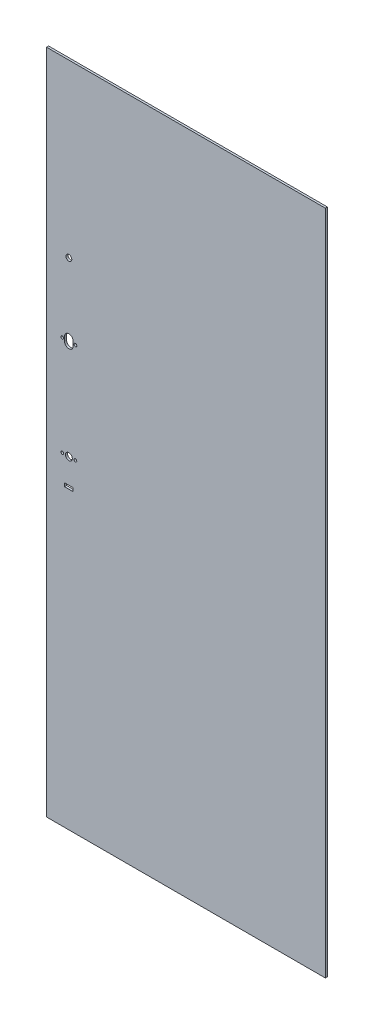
ISO-10303-21;
HEADER;
FILE_DESCRIPTION(('STEP AP214'),'2;1');
FILE_NAME('part.step','',(''),(''),'','','');
FILE_SCHEMA(('AUTOMOTIVE_DESIGN { 1 0 10303 214 1 1 1 1 }'));
ENDSEC;
DATA;
#1=APPLICATION_CONTEXT('core data for automotive mechanical design processes');
#2=APPLICATION_PROTOCOL_DEFINITION('international standard','automotive_design',2000,#1);
#3=PRODUCT_CONTEXT('',#1,'mechanical');
#4=PRODUCT('Part','Part','',(#3));
#5=PRODUCT_RELATED_PRODUCT_CATEGORY('part','',(#4));
#6=PRODUCT_DEFINITION_FORMATION('','',#4);
#7=PRODUCT_DEFINITION_CONTEXT('part definition',#1,'design');
#8=PRODUCT_DEFINITION('design','',#6,#7);
#9=PRODUCT_DEFINITION_SHAPE('','',#8);
#10=(LENGTH_UNIT() NAMED_UNIT(*) SI_UNIT(.MILLI.,.METRE.));
#11=(NAMED_UNIT(*) PLANE_ANGLE_UNIT() SI_UNIT($,.RADIAN.));
#12=(NAMED_UNIT(*) SI_UNIT($,.STERADIAN.) SOLID_ANGLE_UNIT());
#13=UNCERTAINTY_MEASURE_WITH_UNIT(LENGTH_MEASURE(1.E-05),#10,'distance_accuracy_value','');
#14=(GEOMETRIC_REPRESENTATION_CONTEXT(3) GLOBAL_UNCERTAINTY_ASSIGNED_CONTEXT((#13)) GLOBAL_UNIT_ASSIGNED_CONTEXT((#10,
#11,#12)) REPRESENTATION_CONTEXT('',''));
#15=CARTESIAN_POINT('',(0.,0.,0.));
#16=DIRECTION('',(0.,0.,1.));
#17=DIRECTION('',(1.,0.,0.));
#18=AXIS2_PLACEMENT_3D('',#15,#16,#17);
#19=CARTESIAN_POINT('',(-404.5,-969.099999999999,6.));
#20=DIRECTION('',(1.,0.,0.));
#21=DIRECTION('',(0.,0.,-1.));
#22=AXIS2_PLACEMENT_3D('',#19,#20,#21);
#23=PLANE('',#22);
#24=DIRECTION('',(0.,-1.,0.));
#25=VECTOR('',#24,1.);
#26=CARTESIAN_POINT('',(-404.5,-969.099999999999,0.));
#27=LINE('',#26,#25);
#28=CARTESIAN_POINT('',(-404.5,967.9,0.));
#29=VERTEX_POINT('',#28);
#30=CARTESIAN_POINT('',(-404.5,-969.099999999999,0.));
#31=VERTEX_POINT('',#30);
#32=EDGE_CURVE('E208',#29,#31,#27,.T.);
#33=ORIENTED_EDGE('',*,*,#32,.T.);
#34=DIRECTION('',(0.,0.,-1.));
#35=VECTOR('',#34,1.);
#36=CARTESIAN_POINT('',(-404.5,-969.099999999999,6.));
#37=LINE('',#36,#35);
#38=CARTESIAN_POINT('',(-404.5,-969.099999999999,6.));
#39=VERTEX_POINT('',#38);
#40=EDGE_CURVE('E225',#39,#31,#37,.T.);
#41=ORIENTED_EDGE('',*,*,#40,.F.);
#42=DIRECTION('',(0.,-1.,0.));
#43=VECTOR('',#42,1.);
#44=CARTESIAN_POINT('',(-404.5,-969.099999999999,6.));
#45=LINE('',#44,#43);
#46=CARTESIAN_POINT('',(-404.5,967.9,6.));
#47=VERTEX_POINT('',#46);
#48=EDGE_CURVE('E197',#47,#39,#45,.T.);
#49=ORIENTED_EDGE('',*,*,#48,.F.);
#50=DIRECTION('',(0.,0.,-1.));
#51=VECTOR('',#50,1.);
#52=CARTESIAN_POINT('',(-404.5,967.9,6.));
#53=LINE('',#52,#51);
#54=EDGE_CURVE('E207',#47,#29,#53,.T.);
#55=ORIENTED_EDGE('',*,*,#54,.T.);
#56=EDGE_LOOP('',(#33,#41,#49,#55));
#57=FACE_BOUND('',#56,.T.);
#58=ADVANCED_FACE('F38',(#57),#23,.F.);
#59=CARTESIAN_POINT('',(-404.5,-969.099999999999,6.));
#60=DIRECTION('',(0.,1.,0.));
#61=DIRECTION('',(0.,0.,1.));
#62=AXIS2_PLACEMENT_3D('',#59,#60,#61);
#63=PLANE('',#62);
#64=DIRECTION('',(1.,0.,0.));
#65=VECTOR('',#64,1.);
#66=CARTESIAN_POINT('',(-404.5,-969.099999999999,0.));
#67=LINE('',#66,#65);
#68=CARTESIAN_POINT('',(405.5,-969.099999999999,0.));
#69=VERTEX_POINT('',#68);
#70=EDGE_CURVE('E211',#31,#69,#67,.T.);
#71=ORIENTED_EDGE('',*,*,#70,.T.);
#72=DIRECTION('',(0.,0.,-1.));
#73=VECTOR('',#72,1.);
#74=CARTESIAN_POINT('',(405.5,-969.099999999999,6.));
#75=LINE('',#74,#73);
#76=CARTESIAN_POINT('',(405.5,-969.099999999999,6.));
#77=VERTEX_POINT('',#76);
#78=EDGE_CURVE('E222',#77,#69,#75,.T.);
#79=ORIENTED_EDGE('',*,*,#78,.F.);
#80=DIRECTION('',(1.,0.,0.));
#81=VECTOR('',#80,1.);
#82=CARTESIAN_POINT('',(-404.5,-969.099999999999,6.));
#83=LINE('',#82,#81);
#84=EDGE_CURVE('E200',#39,#77,#83,.T.);
#85=ORIENTED_EDGE('',*,*,#84,.F.);
#86=ORIENTED_EDGE('',*,*,#40,.T.);
#87=EDGE_LOOP('',(#71,#79,#85,#86));
#88=FACE_BOUND('',#87,.T.);
#89=ADVANCED_FACE('F273',(#88),#63,.F.);
#90=CARTESIAN_POINT('',(405.5,-969.099999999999,6.));
#91=DIRECTION('',(-1.,0.,0.));
#92=DIRECTION('',(0.,0.,1.));
#93=AXIS2_PLACEMENT_3D('',#90,#91,#92);
#94=PLANE('',#93);
#95=DIRECTION('',(0.,1.,0.));
#96=VECTOR('',#95,1.);
#97=CARTESIAN_POINT('',(405.5,-969.099999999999,0.));
#98=LINE('',#97,#96);
#99=CARTESIAN_POINT('',(405.5,967.9,0.));
#100=VERTEX_POINT('',#99);
#101=EDGE_CURVE('E214',#69,#100,#98,.T.);
#102=ORIENTED_EDGE('',*,*,#101,.T.);
#103=DIRECTION('',(0.,0.,-1.));
#104=VECTOR('',#103,1.);
#105=CARTESIAN_POINT('',(405.5,967.9,6.));
#106=LINE('',#105,#104);
#107=CARTESIAN_POINT('',(405.5,967.9,6.));
#108=VERTEX_POINT('',#107);
#109=EDGE_CURVE('E219',#108,#100,#106,.T.);
#110=ORIENTED_EDGE('',*,*,#109,.F.);
#111=DIRECTION('',(0.,1.,0.));
#112=VECTOR('',#111,1.);
#113=CARTESIAN_POINT('',(405.5,-969.099999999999,6.));
#114=LINE('',#113,#112);
#115=EDGE_CURVE('E203',#77,#108,#114,.T.);
#116=ORIENTED_EDGE('',*,*,#115,.F.);
#117=ORIENTED_EDGE('',*,*,#78,.T.);
#118=EDGE_LOOP('',(#102,#110,#116,#117));
#119=FACE_BOUND('',#118,.T.);
#120=ADVANCED_FACE('F278',(#119),#94,.F.);
#121=CARTESIAN_POINT('',(-404.5,967.9,6.));
#122=DIRECTION('',(0.,-1.,0.));
#123=DIRECTION('',(0.,0.,-1.));
#124=AXIS2_PLACEMENT_3D('',#121,#122,#123);
#125=PLANE('',#124);
#126=DIRECTION('',(-1.,0.,0.));
#127=VECTOR('',#126,1.);
#128=CARTESIAN_POINT('',(-404.5,967.9,0.));
#129=LINE('',#128,#127);
#130=EDGE_CURVE('E201',#100,#29,#129,.T.);
#131=ORIENTED_EDGE('',*,*,#130,.T.);
#132=ORIENTED_EDGE('',*,*,#54,.F.);
#133=DIRECTION('',(-1.,0.,0.));
#134=VECTOR('',#133,1.);
#135=CARTESIAN_POINT('',(-404.5,967.9,6.));
#136=LINE('',#135,#134);
#137=EDGE_CURVE('E205',#108,#47,#136,.T.);
#138=ORIENTED_EDGE('',*,*,#137,.F.);
#139=ORIENTED_EDGE('',*,*,#109,.T.);
#140=EDGE_LOOP('',(#131,#132,#138,#139));
#141=FACE_BOUND('',#140,.T.);
#142=ADVANCED_FACE('F293',(#141),#125,.F.);
#143=CARTESIAN_POINT('',(0.,0.,6.));
#144=DIRECTION('',(0.,0.,-1.));
#145=DIRECTION('',(-1.,0.,0.));
#146=AXIS2_PLACEMENT_3D('',#143,#144,#145);
#147=PLANE('',#146);
#148=DIRECTION('',(1.,0.,0.));
#149=VECTOR('',#148,1.);
#150=CARTESIAN_POINT('',(-352.199999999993,-101.800000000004,6.00000000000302));
#151=LINE('',#150,#149);
#152=CARTESIAN_POINT('',(-352.199999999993,-101.800000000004,6.00000000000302));
#153=VERTEX_POINT('',#152);
#154=CARTESIAN_POINT('',(-327.199999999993,-101.800000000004,6.00000000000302));
#155=VERTEX_POINT('',#154);
#156=EDGE_CURVE('E138',#153,#155,#151,.T.);
#157=ORIENTED_EDGE('',*,*,#156,.T.);
#158=DIRECTION('',(0.,-1.,0.));
#159=VECTOR('',#158,1.);
#160=CARTESIAN_POINT('',(-327.199999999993,-101.800000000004,6.00000000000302));
#161=LINE('',#160,#159);
#162=CARTESIAN_POINT('',(-327.199999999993,-111.800000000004,6.00000000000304));
#163=VERTEX_POINT('',#162);
#164=EDGE_CURVE('E132',#155,#163,#161,.T.);
#165=ORIENTED_EDGE('',*,*,#164,.T.);
#166=DIRECTION('',(-1.,0.,0.));
#167=VECTOR('',#166,1.);
#168=CARTESIAN_POINT('',(-327.199999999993,-111.800000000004,6.00000000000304));
#169=LINE('',#168,#167);
#170=CARTESIAN_POINT('',(-352.199999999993,-111.800000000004,6.));
#171=VERTEX_POINT('',#170);
#172=EDGE_CURVE('E141',#163,#171,#169,.T.);
#173=ORIENTED_EDGE('',*,*,#172,.T.);
#174=DIRECTION('',(0.,1.,0.));
#175=VECTOR('',#174,1.);
#176=CARTESIAN_POINT('',(-352.199999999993,-111.800000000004,6.00000000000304));
#177=LINE('',#176,#175);
#178=EDGE_CURVE('E52',#171,#153,#177,.T.);
#179=ORIENTED_EDGE('',*,*,#178,.T.);
#180=EDGE_LOOP('',(#157,#165,#173,#179));
#181=FACE_BOUND('',#180,.T.);
#182=CARTESIAN_POINT('',(-320.699999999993,260.399999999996,6.000000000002));
#183=DIRECTION('',(0.,0.,-1.));
#184=DIRECTION('',(0.,1.,0.));
#185=AXIS2_PLACEMENT_3D('',#182,#183,#184);
#186=CIRCLE('',#185,4.09999999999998);
#187=CARTESIAN_POINT('',(-320.699999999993,264.499999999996,6.00000000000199));
#188=VERTEX_POINT('',#187);
#189=EDGE_CURVE('E170',#188,#188,#186,.T.);
#190=ORIENTED_EDGE('',*,*,#189,.T.);
#191=EDGE_LOOP('',(#190));
#192=FACE_BOUND('',#191,.T.);
#193=CARTESIAN_POINT('',(-358.699999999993,260.399999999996,6.000000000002));
#194=DIRECTION('',(0.,0.,-1.));
#195=DIRECTION('',(0.,1.,0.));
#196=AXIS2_PLACEMENT_3D('',#193,#194,#195);
#197=CIRCLE('',#196,4.09999999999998);
#198=CARTESIAN_POINT('',(-358.699999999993,264.499999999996,6.00000000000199));
#199=VERTEX_POINT('',#198);
#200=EDGE_CURVE('E167',#199,#199,#197,.T.);
#201=ORIENTED_EDGE('',*,*,#200,.T.);
#202=EDGE_LOOP('',(#201));
#203=FACE_BOUND('',#202,.T.);
#204=CARTESIAN_POINT('',(-339.699999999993,470.200000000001,6.00000000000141));
#205=DIRECTION('',(0.,0.,-1.));
#206=DIRECTION('',(0.,1.,0.));
#207=AXIS2_PLACEMENT_3D('',#204,#205,#206);
#208=CIRCLE('',#207,8.50000000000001);
#209=CARTESIAN_POINT('',(-339.699999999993,478.700000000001,6.00000000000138));
#210=VERTEX_POINT('',#209);
#211=EDGE_CURVE('E163',#210,#210,#208,.T.);
#212=ORIENTED_EDGE('',*,*,#211,.T.);
#213=EDGE_LOOP('',(#212));
#214=FACE_BOUND('',#213,.T.);
#215=CARTESIAN_POINT('',(-339.699999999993,-29.8000000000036,6.00000000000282));
#216=DIRECTION('',(0.,0.,-1.));
#217=DIRECTION('',(0.,1.,0.));
#218=AXIS2_PLACEMENT_3D('',#215,#216,#217);
#219=CIRCLE('',#218,9.99999999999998);
#220=CARTESIAN_POINT('',(-339.699999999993,-19.8000000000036,6.0000000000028));
#221=VERTEX_POINT('',#220);
#222=EDGE_CURVE('E148',#221,#221,#219,.T.);
#223=ORIENTED_EDGE('',*,*,#222,.T.);
#224=EDGE_LOOP('',(#223));
#225=FACE_BOUND('',#224,.T.);
#226=DIRECTION('',(0.,1.,0.));
#227=VECTOR('',#226,1.);
#228=CARTESIAN_POINT('',(-352.199999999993,254.149999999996,6.00000000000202));
#229=LINE('',#228,#227);
#230=CARTESIAN_POINT('',(-352.199999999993,254.149999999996,6.00000000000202));
#231=VERTEX_POINT('',#230);
#232=CARTESIAN_POINT('',(-352.199999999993,266.649999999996,6.00000000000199));
#233=VERTEX_POINT('',#232);
#234=EDGE_CURVE('E185',#231,#233,#229,.T.);
#235=ORIENTED_EDGE('',*,*,#234,.T.);
#236=CARTESIAN_POINT('',(-339.699999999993,266.649999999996,6.00000000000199));
#237=DIRECTION('',(0.,0.,-1.));
#238=DIRECTION('',(0.,1.,0.));
#239=AXIS2_PLACEMENT_3D('',#236,#237,#238);
#240=CIRCLE('',#239,12.5);
#241=CARTESIAN_POINT('',(-327.199999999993,266.649999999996,6.00000000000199));
#242=VERTEX_POINT('',#241);
#243=EDGE_CURVE('E176',#233,#242,#240,.T.);
#244=ORIENTED_EDGE('',*,*,#243,.T.);
#245=DIRECTION('',(0.,-1.,0.));
#246=VECTOR('',#245,1.);
#247=CARTESIAN_POINT('',(-327.199999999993,266.649999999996,6.00000000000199));
#248=LINE('',#247,#246);
#249=CARTESIAN_POINT('',(-327.199999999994,254.149999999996,6.));
#250=VERTEX_POINT('',#249);
#251=EDGE_CURVE('E181',#242,#250,#248,.T.);
#252=ORIENTED_EDGE('',*,*,#251,.T.);
#253=CARTESIAN_POINT('',(-339.699999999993,254.149999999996,6.00000000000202));
#254=DIRECTION('',(0.,0.,-1.));
#255=DIRECTION('',(0.,1.,0.));
#256=AXIS2_PLACEMENT_3D('',#253,#254,#255);
#257=CIRCLE('',#256,12.5);
#258=EDGE_CURVE('E60',#250,#231,#257,.T.);
#259=ORIENTED_EDGE('',*,*,#258,.T.);
#260=EDGE_LOOP('',(#235,#244,#252,#259));
#261=FACE_BOUND('',#260,.T.);
#262=CARTESIAN_POINT('',(-358.699999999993,-29.8000000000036,6.00000000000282));
#263=DIRECTION('',(0.,0.,-1.));
#264=DIRECTION('',(0.,1.,0.));
#265=AXIS2_PLACEMENT_3D('',#262,#263,#264);
#266=CIRCLE('',#265,3.99999999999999);
#267=CARTESIAN_POINT('',(-358.699999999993,-25.8000000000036,6.00000000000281));
#268=VERTEX_POINT('',#267);
#269=EDGE_CURVE('E173',#268,#268,#266,.T.);
#270=ORIENTED_EDGE('',*,*,#269,.T.);
#271=EDGE_LOOP('',(#270));
#272=FACE_BOUND('',#271,.T.);
#273=CARTESIAN_POINT('',(-320.699999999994,-29.8000000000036,6.00000000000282));
#274=DIRECTION('',(0.,0.,-1.));
#275=DIRECTION('',(0.,1.,0.));
#276=AXIS2_PLACEMENT_3D('',#273,#274,#275);
#277=CIRCLE('',#276,3.99999999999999);
#278=CARTESIAN_POINT('',(-320.699999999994,-25.8000000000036,6.00000000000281));
#279=VERTEX_POINT('',#278);
#280=EDGE_CURVE('E166',#279,#279,#277,.T.);
#281=ORIENTED_EDGE('',*,*,#280,.T.);
#282=EDGE_LOOP('',(#281));
#283=FACE_BOUND('',#282,.T.);
#284=ORIENTED_EDGE('',*,*,#48,.T.);
#285=ORIENTED_EDGE('',*,*,#84,.T.);
#286=ORIENTED_EDGE('',*,*,#115,.T.);
#287=ORIENTED_EDGE('',*,*,#137,.T.);
#288=EDGE_LOOP('',(#284,#285,#286,#287));
#289=FACE_BOUND('',#288,.T.);
#290=ADVANCED_FACE('F145',(#181,#192,#203,#214,#225,#261,#272,#283,#289),#147,.F.);
#291=CARTESIAN_POINT('',(0.,0.,0.));
#292=DIRECTION('',(0.,0.,-1.));
#293=DIRECTION('',(-1.,0.,0.));
#294=AXIS2_PLACEMENT_3D('',#291,#292,#293);
#295=PLANE('',#294);
#296=DIRECTION('',(0.,-1.,0.));
#297=VECTOR('',#296,1.);
#298=CARTESIAN_POINT('',(-327.199999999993,0.,0.));
#299=LINE('',#298,#297);
#300=CARTESIAN_POINT('',(-327.199999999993,-101.800000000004,0.));
#301=VERTEX_POINT('',#300);
#302=CARTESIAN_POINT('',(-327.199999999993,-111.800000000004,0.));
#303=VERTEX_POINT('',#302);
#304=EDGE_CURVE('E11',#301,#303,#299,.T.);
#305=ORIENTED_EDGE('',*,*,#304,.F.);
#306=DIRECTION('',(1.,0.,0.));
#307=VECTOR('',#306,1.);
#308=CARTESIAN_POINT('',(0.,-101.800000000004,0.));
#309=LINE('',#308,#307);
#310=CARTESIAN_POINT('',(-352.199999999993,-101.800000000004,0.));
#311=VERTEX_POINT('',#310);
#312=EDGE_CURVE('E45',#311,#301,#309,.T.);
#313=ORIENTED_EDGE('',*,*,#312,.F.);
#314=DIRECTION('',(0.,1.,0.));
#315=VECTOR('',#314,1.);
#316=CARTESIAN_POINT('',(-352.199999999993,0.,0.));
#317=LINE('',#316,#315);
#318=CARTESIAN_POINT('',(-352.199999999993,-111.800000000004,0.));
#319=VERTEX_POINT('',#318);
#320=EDGE_CURVE('E255',#319,#311,#317,.T.);
#321=ORIENTED_EDGE('',*,*,#320,.F.);
#322=DIRECTION('',(-1.,0.,0.));
#323=VECTOR('',#322,1.);
#324=CARTESIAN_POINT('',(0.,-111.800000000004,0.));
#325=LINE('',#324,#323);
#326=EDGE_CURVE('E243',#303,#319,#325,.T.);
#327=ORIENTED_EDGE('',*,*,#326,.F.);
#328=EDGE_LOOP('',(#305,#313,#321,#327));
#329=FACE_BOUND('',#328,.T.);
#330=CARTESIAN_POINT('',(-320.699999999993,260.399999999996,0.));
#331=DIRECTION('',(0.,0.,-1.));
#332=DIRECTION('',(-1.,0.,0.));
#333=AXIS2_PLACEMENT_3D('',#330,#331,#332);
#334=CIRCLE('',#333,4.09999999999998);
#335=CARTESIAN_POINT('',(-324.799999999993,260.399999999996,0.));
#336=VERTEX_POINT('',#335);
#337=EDGE_CURVE('E212',#336,#336,#334,.T.);
#338=ORIENTED_EDGE('',*,*,#337,.F.);
#339=EDGE_LOOP('',(#338));
#340=FACE_BOUND('',#339,.T.);
#341=CARTESIAN_POINT('',(-358.699999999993,260.399999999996,0.));
#342=DIRECTION('',(0.,0.,-1.));
#343=DIRECTION('',(-1.,0.,0.));
#344=AXIS2_PLACEMENT_3D('',#341,#342,#343);
#345=CIRCLE('',#344,4.09999999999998);
#346=CARTESIAN_POINT('',(-362.799999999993,260.399999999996,0.));
#347=VERTEX_POINT('',#346);
#348=EDGE_CURVE('E249',#347,#347,#345,.T.);
#349=ORIENTED_EDGE('',*,*,#348,.F.);
#350=EDGE_LOOP('',(#349));
#351=FACE_BOUND('',#350,.T.);
#352=CARTESIAN_POINT('',(-339.699999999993,470.200000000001,0.));
#353=DIRECTION('',(0.,0.,-1.));
#354=DIRECTION('',(-1.,0.,0.));
#355=AXIS2_PLACEMENT_3D('',#352,#353,#354);
#356=CIRCLE('',#355,8.50000000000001);
#357=CARTESIAN_POINT('',(-348.199999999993,470.200000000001,0.));
#358=VERTEX_POINT('',#357);
#359=EDGE_CURVE('E246',#358,#358,#356,.T.);
#360=ORIENTED_EDGE('',*,*,#359,.F.);
#361=EDGE_LOOP('',(#360));
#362=FACE_BOUND('',#361,.T.);
#363=CARTESIAN_POINT('',(-339.699999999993,-29.8000000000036,0.));
#364=DIRECTION('',(0.,0.,-1.));
#365=DIRECTION('',(-1.,0.,0.));
#366=AXIS2_PLACEMENT_3D('',#363,#364,#365);
#367=CIRCLE('',#366,9.99999999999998);
#368=CARTESIAN_POINT('',(-349.699999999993,-29.8000000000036,0.));
#369=VERTEX_POINT('',#368);
#370=EDGE_CURVE('E234',#369,#369,#367,.T.);
#371=ORIENTED_EDGE('',*,*,#370,.F.);
#372=EDGE_LOOP('',(#371));
#373=FACE_BOUND('',#372,.T.);
#374=CARTESIAN_POINT('',(-339.699999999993,266.649999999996,0.));
#375=DIRECTION('',(0.,0.,-1.));
#376=DIRECTION('',(-1.,0.,0.));
#377=AXIS2_PLACEMENT_3D('',#374,#375,#376);
#378=CIRCLE('',#377,12.5);
#379=CARTESIAN_POINT('',(-352.199999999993,266.649999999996,0.));
#380=VERTEX_POINT('',#379);
#381=CARTESIAN_POINT('',(-327.199999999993,266.649999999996,0.));
#382=VERTEX_POINT('',#381);
#383=EDGE_CURVE('E240',#380,#382,#378,.T.);
#384=ORIENTED_EDGE('',*,*,#383,.F.);
#385=DIRECTION('',(0.,1.,0.));
#386=VECTOR('',#385,1.);
#387=CARTESIAN_POINT('',(-352.199999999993,0.,0.));
#388=LINE('',#387,#386);
#389=CARTESIAN_POINT('',(-352.199999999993,254.149999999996,0.));
#390=VERTEX_POINT('',#389);
#391=EDGE_CURVE('E238',#390,#380,#388,.T.);
#392=ORIENTED_EDGE('',*,*,#391,.F.);
#393=CARTESIAN_POINT('',(-339.699999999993,254.149999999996,0.));
#394=DIRECTION('',(0.,0.,-1.));
#395=DIRECTION('',(-1.,0.,0.));
#396=AXIS2_PLACEMENT_3D('',#393,#394,#395);
#397=CIRCLE('',#396,12.5);
#398=CARTESIAN_POINT('',(-327.199999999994,254.149999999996,0.));
#399=VERTEX_POINT('',#398);
#400=EDGE_CURVE('E236',#399,#390,#397,.T.);
#401=ORIENTED_EDGE('',*,*,#400,.F.);
#402=DIRECTION('',(0.,-1.,0.));
#403=VECTOR('',#402,1.);
#404=CARTESIAN_POINT('',(-327.199999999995,1.45305989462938E-12,0.));
#405=LINE('',#404,#403);
#406=EDGE_CURVE('E228',#382,#399,#405,.T.);
#407=ORIENTED_EDGE('',*,*,#406,.F.);
#408=EDGE_LOOP('',(#384,#392,#401,#407));
#409=FACE_BOUND('',#408,.T.);
#410=CARTESIAN_POINT('',(-358.699999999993,-29.8000000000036,0.));
#411=DIRECTION('',(0.,0.,-1.));
#412=DIRECTION('',(-1.,0.,0.));
#413=AXIS2_PLACEMENT_3D('',#410,#411,#412);
#414=CIRCLE('',#413,3.99999999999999);
#415=CARTESIAN_POINT('',(-362.699999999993,-29.8000000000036,0.));
#416=VERTEX_POINT('',#415);
#417=EDGE_CURVE('E231',#416,#416,#414,.T.);
#418=ORIENTED_EDGE('',*,*,#417,.F.);
#419=EDGE_LOOP('',(#418));
#420=FACE_BOUND('',#419,.T.);
#421=CARTESIAN_POINT('',(-320.699999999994,-29.8000000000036,0.));
#422=DIRECTION('',(0.,0.,-1.));
#423=DIRECTION('',(-1.,0.,0.));
#424=AXIS2_PLACEMENT_3D('',#421,#422,#423);
#425=CIRCLE('',#424,3.99999999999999);
#426=CARTESIAN_POINT('',(-324.699999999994,-29.8000000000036,0.));
#427=VERTEX_POINT('',#426);
#428=EDGE_CURVE('E158',#427,#427,#425,.T.);
#429=ORIENTED_EDGE('',*,*,#428,.F.);
#430=EDGE_LOOP('',(#429));
#431=FACE_BOUND('',#430,.T.);
#432=ORIENTED_EDGE('',*,*,#32,.F.);
#433=ORIENTED_EDGE('',*,*,#130,.F.);
#434=ORIENTED_EDGE('',*,*,#101,.F.);
#435=ORIENTED_EDGE('',*,*,#70,.F.);
#436=EDGE_LOOP('',(#432,#433,#434,#435));
#437=FACE_BOUND('',#436,.T.);
#438=ADVANCED_FACE('F261',(#329,#340,#351,#362,#373,#409,#420,#431,#437),#295,.T.);
#439=CARTESIAN_POINT('',(-320.699999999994,-29.8000000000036,6.00000000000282));
#440=DIRECTION('',(0.,0.,-1.));
#441=DIRECTION('',(0.,1.,0.));
#442=AXIS2_PLACEMENT_3D('',#439,#440,#441);
#443=CYLINDRICAL_SURFACE('',#442,3.99999999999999);
#444=ORIENTED_EDGE('',*,*,#428,.T.);
#445=EDGE_LOOP('',(#444));
#446=FACE_BOUND('',#445,.T.);
#447=ORIENTED_EDGE('',*,*,#280,.F.);
#448=EDGE_LOOP('',(#447));
#449=FACE_BOUND('',#448,.T.);
#450=ADVANCED_FACE('F304',(#446,#449),#443,.F.);
#451=CARTESIAN_POINT('',(-358.699999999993,-29.8000000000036,6.00000000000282));
#452=DIRECTION('',(0.,0.,-1.));
#453=DIRECTION('',(0.,1.,0.));
#454=AXIS2_PLACEMENT_3D('',#451,#452,#453);
#455=CYLINDRICAL_SURFACE('',#454,3.99999999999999);
#456=ORIENTED_EDGE('',*,*,#417,.T.);
#457=EDGE_LOOP('',(#456));
#458=FACE_BOUND('',#457,.T.);
#459=ORIENTED_EDGE('',*,*,#269,.F.);
#460=EDGE_LOOP('',(#459));
#461=FACE_BOUND('',#460,.T.);
#462=ADVANCED_FACE('F311',(#458,#461),#455,.F.);
#463=CARTESIAN_POINT('',(-339.699999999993,266.649999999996,6.00000000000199));
#464=DIRECTION('',(0.,0.,-1.));
#465=DIRECTION('',(0.,1.,0.));
#466=AXIS2_PLACEMENT_3D('',#463,#464,#465);
#467=CYLINDRICAL_SURFACE('',#466,12.5);
#468=ORIENTED_EDGE('',*,*,#383,.T.);
#469=DIRECTION('',(0.,0.,-1.));
#470=VECTOR('',#469,1.);
#471=CARTESIAN_POINT('',(-327.199999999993,266.649999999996,6.00000000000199));
#472=LINE('',#471,#470);
#473=EDGE_CURVE('E188',#242,#382,#472,.T.);
#474=ORIENTED_EDGE('',*,*,#473,.F.);
#475=ORIENTED_EDGE('',*,*,#243,.F.);
#476=DIRECTION('',(0.,0.,-1.));
#477=VECTOR('',#476,1.);
#478=CARTESIAN_POINT('',(-352.199999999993,266.649999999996,6.00000000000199));
#479=LINE('',#478,#477);
#480=EDGE_CURVE('E151',#233,#380,#479,.T.);
#481=ORIENTED_EDGE('',*,*,#480,.T.);
#482=EDGE_LOOP('',(#468,#474,#475,#481));
#483=FACE_BOUND('',#482,.T.);
#484=ADVANCED_FACE('F307',(#483),#467,.F.);
#485=CARTESIAN_POINT('',(-352.199999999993,254.149999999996,6.00000000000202));
#486=DIRECTION('',(-1.,0.,0.));
#487=DIRECTION('',(0.,0.,1.));
#488=AXIS2_PLACEMENT_3D('',#485,#486,#487);
#489=PLANE('',#488);
#490=ORIENTED_EDGE('',*,*,#391,.T.);
#491=ORIENTED_EDGE('',*,*,#480,.F.);
#492=ORIENTED_EDGE('',*,*,#234,.F.);
#493=DIRECTION('',(0.,0.,-1.));
#494=VECTOR('',#493,1.);
#495=CARTESIAN_POINT('',(-352.199999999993,254.149999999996,6.00000000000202));
#496=LINE('',#495,#494);
#497=EDGE_CURVE('E191',#231,#390,#496,.T.);
#498=ORIENTED_EDGE('',*,*,#497,.T.);
#499=EDGE_LOOP('',(#490,#491,#492,#498));
#500=FACE_BOUND('',#499,.T.);
#501=ADVANCED_FACE('F310',(#500),#489,.F.);
#502=CARTESIAN_POINT('',(-339.699999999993,254.149999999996,6.00000000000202));
#503=DIRECTION('',(0.,0.,-1.));
#504=DIRECTION('',(0.,1.,0.));
#505=AXIS2_PLACEMENT_3D('',#502,#503,#504);
#506=CYLINDRICAL_SURFACE('',#505,12.5);
#507=ORIENTED_EDGE('',*,*,#400,.T.);
#508=ORIENTED_EDGE('',*,*,#497,.F.);
#509=ORIENTED_EDGE('',*,*,#258,.F.);
#510=DIRECTION('',(0.,0.,-1.));
#511=VECTOR('',#510,1.);
#512=CARTESIAN_POINT('',(-327.199999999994,254.149999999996,6.00000000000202));
#513=LINE('',#512,#511);
#514=EDGE_CURVE('E194',#250,#399,#513,.T.);
#515=ORIENTED_EDGE('',*,*,#514,.T.);
#516=EDGE_LOOP('',(#507,#508,#509,#515));
#517=FACE_BOUND('',#516,.T.);
#518=ADVANCED_FACE('F317',(#517),#506,.F.);
#519=CARTESIAN_POINT('',(-327.199999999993,266.649999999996,6.00000000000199));
#520=DIRECTION('',(1.,0.,0.));
#521=DIRECTION('',(0.,1.,0.));
#522=AXIS2_PLACEMENT_3D('',#519,#520,#521);
#523=PLANE('',#522);
#524=ORIENTED_EDGE('',*,*,#406,.T.);
#525=ORIENTED_EDGE('',*,*,#514,.F.);
#526=ORIENTED_EDGE('',*,*,#251,.F.);
#527=ORIENTED_EDGE('',*,*,#473,.T.);
#528=EDGE_LOOP('',(#524,#525,#526,#527));
#529=FACE_BOUND('',#528,.T.);
#530=ADVANCED_FACE('F313',(#529),#523,.F.);
#531=CARTESIAN_POINT('',(-339.699999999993,-29.8000000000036,6.00000000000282));
#532=DIRECTION('',(0.,0.,-1.));
#533=DIRECTION('',(0.,1.,0.));
#534=AXIS2_PLACEMENT_3D('',#531,#532,#533);
#535=CYLINDRICAL_SURFACE('',#534,9.99999999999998);
#536=ORIENTED_EDGE('',*,*,#370,.T.);
#537=EDGE_LOOP('',(#536));
#538=FACE_BOUND('',#537,.T.);
#539=ORIENTED_EDGE('',*,*,#222,.F.);
#540=EDGE_LOOP('',(#539));
#541=FACE_BOUND('',#540,.T.);
#542=ADVANCED_FACE('F316',(#538,#541),#535,.F.);
#543=CARTESIAN_POINT('',(-339.699999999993,470.200000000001,6.00000000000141));
#544=DIRECTION('',(0.,0.,-1.));
#545=DIRECTION('',(0.,1.,0.));
#546=AXIS2_PLACEMENT_3D('',#543,#544,#545);
#547=CYLINDRICAL_SURFACE('',#546,8.50000000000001);
#548=ORIENTED_EDGE('',*,*,#359,.T.);
#549=EDGE_LOOP('',(#548));
#550=FACE_BOUND('',#549,.T.);
#551=ORIENTED_EDGE('',*,*,#211,.F.);
#552=EDGE_LOOP('',(#551));
#553=FACE_BOUND('',#552,.T.);
#554=ADVANCED_FACE('F326',(#550,#553),#547,.F.);
#555=CARTESIAN_POINT('',(-358.699999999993,260.399999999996,6.000000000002));
#556=DIRECTION('',(0.,0.,-1.));
#557=DIRECTION('',(0.,1.,0.));
#558=AXIS2_PLACEMENT_3D('',#555,#556,#557);
#559=CYLINDRICAL_SURFACE('',#558,4.09999999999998);
#560=ORIENTED_EDGE('',*,*,#348,.T.);
#561=EDGE_LOOP('',(#560));
#562=FACE_BOUND('',#561,.T.);
#563=ORIENTED_EDGE('',*,*,#200,.F.);
#564=EDGE_LOOP('',(#563));
#565=FACE_BOUND('',#564,.T.);
#566=ADVANCED_FACE('F337',(#562,#565),#559,.F.);
#567=CARTESIAN_POINT('',(-320.699999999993,260.399999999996,6.000000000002));
#568=DIRECTION('',(0.,0.,-1.));
#569=DIRECTION('',(0.,1.,0.));
#570=AXIS2_PLACEMENT_3D('',#567,#568,#569);
#571=CYLINDRICAL_SURFACE('',#570,4.09999999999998);
#572=ORIENTED_EDGE('',*,*,#337,.T.);
#573=EDGE_LOOP('',(#572));
#574=FACE_BOUND('',#573,.T.);
#575=ORIENTED_EDGE('',*,*,#189,.F.);
#576=EDGE_LOOP('',(#575));
#577=FACE_BOUND('',#576,.T.);
#578=ADVANCED_FACE('F334',(#574,#577),#571,.F.);
#579=CARTESIAN_POINT('',(-327.199999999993,-101.800000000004,6.00000000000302));
#580=DIRECTION('',(1.,0.,0.));
#581=DIRECTION('',(0.,0.,-1.));
#582=AXIS2_PLACEMENT_3D('',#579,#580,#581);
#583=PLANE('',#582);
#584=ORIENTED_EDGE('',*,*,#304,.T.);
#585=DIRECTION('',(0.,0.,-1.));
#586=VECTOR('',#585,1.);
#587=CARTESIAN_POINT('',(-327.199999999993,-111.800000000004,6.00000000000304));
#588=LINE('',#587,#586);
#589=EDGE_CURVE('E127',#163,#303,#588,.T.);
#590=ORIENTED_EDGE('',*,*,#589,.F.);
#591=ORIENTED_EDGE('',*,*,#164,.F.);
#592=DIRECTION('',(0.,0.,-1.));
#593=VECTOR('',#592,1.);
#594=CARTESIAN_POINT('',(-327.199999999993,-101.800000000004,6.00000000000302));
#595=LINE('',#594,#593);
#596=EDGE_CURVE('E156',#155,#301,#595,.T.);
#597=ORIENTED_EDGE('',*,*,#596,.T.);
#598=EDGE_LOOP('',(#584,#590,#591,#597));
#599=FACE_BOUND('',#598,.T.);
#600=ADVANCED_FACE('F129',(#599),#583,.F.);
#601=CARTESIAN_POINT('',(-352.199999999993,-101.800000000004,6.00000000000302));
#602=DIRECTION('',(0.,1.,0.));
#603=DIRECTION('',(0.,0.,1.));
#604=AXIS2_PLACEMENT_3D('',#601,#602,#603);
#605=PLANE('',#604);
#606=ORIENTED_EDGE('',*,*,#312,.T.);
#607=ORIENTED_EDGE('',*,*,#596,.F.);
#608=ORIENTED_EDGE('',*,*,#156,.F.);
#609=DIRECTION('',(0.,0.,-1.));
#610=VECTOR('',#609,1.);
#611=CARTESIAN_POINT('',(-352.199999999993,-101.800000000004,6.00000000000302));
#612=LINE('',#611,#610);
#613=EDGE_CURVE('E159',#153,#311,#612,.T.);
#614=ORIENTED_EDGE('',*,*,#613,.T.);
#615=EDGE_LOOP('',(#606,#607,#608,#614));
#616=FACE_BOUND('',#615,.T.);
#617=ADVANCED_FACE('F258',(#616),#605,.F.);
#618=CARTESIAN_POINT('',(-352.199999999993,-111.800000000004,6.00000000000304));
#619=DIRECTION('',(-1.,0.,0.));
#620=DIRECTION('',(0.,0.,1.));
#621=AXIS2_PLACEMENT_3D('',#618,#619,#620);
#622=PLANE('',#621);
#623=ORIENTED_EDGE('',*,*,#320,.T.);
#624=ORIENTED_EDGE('',*,*,#613,.F.);
#625=ORIENTED_EDGE('',*,*,#178,.F.);
#626=DIRECTION('',(0.,0.,-1.));
#627=VECTOR('',#626,1.);
#628=CARTESIAN_POINT('',(-352.199999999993,-111.800000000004,6.00000000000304));
#629=LINE('',#628,#627);
#630=EDGE_CURVE('E137',#171,#319,#629,.T.);
#631=ORIENTED_EDGE('',*,*,#630,.T.);
#632=EDGE_LOOP('',(#623,#624,#625,#631));
#633=FACE_BOUND('',#632,.T.);
#634=ADVANCED_FACE('F263',(#633),#622,.F.);
#635=CARTESIAN_POINT('',(-327.199999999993,-111.800000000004,6.00000000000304));
#636=DIRECTION('',(0.,-1.,0.));
#637=DIRECTION('',(0.,0.,-1.));
#638=AXIS2_PLACEMENT_3D('',#635,#636,#637);
#639=PLANE('',#638);
#640=ORIENTED_EDGE('',*,*,#326,.T.);
#641=ORIENTED_EDGE('',*,*,#630,.F.);
#642=ORIENTED_EDGE('',*,*,#172,.F.);
#643=ORIENTED_EDGE('',*,*,#589,.T.);
#644=EDGE_LOOP('',(#640,#641,#642,#643));
#645=FACE_BOUND('',#644,.T.);
#646=ADVANCED_FACE('F142',(#645),#639,.F.);
#647=CLOSED_SHELL('',(#58,#89,#120,#142,#290,#438,#450,#462,#484,#501,#518,#530,#542,#554,#566,
#578,#600,#617,#634,#646));
#648=MANIFOLD_SOLID_BREP('B2',#647);
#649=ADVANCED_BREP_SHAPE_REPRESENTATION('',(#18,#648),#14);
#650=SHAPE_DEFINITION_REPRESENTATION(#9,#649);
ENDSEC;
END-ISO-10303-21;
